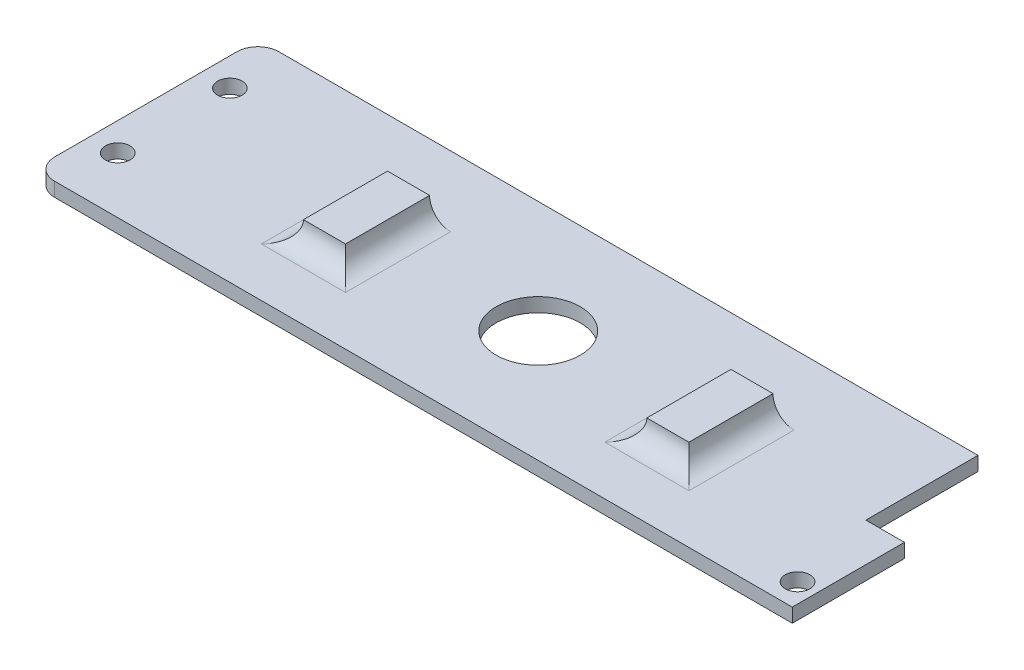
ISO-10303-21;
HEADER;
FILE_DESCRIPTION(('STEP AP214'),'2;1');
FILE_NAME('part.step','',(''),(''),'','','');
FILE_SCHEMA(('AUTOMOTIVE_DESIGN { 1 0 10303 214 1 1 1 1 }'));
ENDSEC;
DATA;
#1=APPLICATION_CONTEXT('core data for automotive mechanical design processes');
#2=APPLICATION_PROTOCOL_DEFINITION('international standard','automotive_design',2000,#1);
#3=PRODUCT_CONTEXT('',#1,'mechanical');
#4=PRODUCT('Part','Part','',(#3));
#5=PRODUCT_RELATED_PRODUCT_CATEGORY('part','',(#4));
#6=PRODUCT_DEFINITION_FORMATION('','',#4);
#7=PRODUCT_DEFINITION_CONTEXT('part definition',#1,'design');
#8=PRODUCT_DEFINITION('design','',#6,#7);
#9=PRODUCT_DEFINITION_SHAPE('','',#8);
#10=(LENGTH_UNIT() NAMED_UNIT(*) SI_UNIT(.MILLI.,.METRE.));
#11=(NAMED_UNIT(*) PLANE_ANGLE_UNIT() SI_UNIT($,.RADIAN.));
#12=(NAMED_UNIT(*) SI_UNIT($,.STERADIAN.) SOLID_ANGLE_UNIT());
#13=UNCERTAINTY_MEASURE_WITH_UNIT(LENGTH_MEASURE(1.E-05),#10,'distance_accuracy_value','');
#14=(GEOMETRIC_REPRESENTATION_CONTEXT(3) GLOBAL_UNCERTAINTY_ASSIGNED_CONTEXT((#13)) GLOBAL_UNIT_ASSIGNED_CONTEXT((#10,
#11,#12)) REPRESENTATION_CONTEXT('',''));
#15=CARTESIAN_POINT('',(0.,0.,0.));
#16=DIRECTION('',(0.,0.,1.));
#17=DIRECTION('',(1.,0.,0.));
#18=AXIS2_PLACEMENT_3D('',#15,#16,#17);
#19=CARTESIAN_POINT('',(-47.25,-2.01,-16.));
#20=DIRECTION('',(-1.,0.,0.));
#21=DIRECTION('',(0.,0.,1.));
#22=AXIS2_PLACEMENT_3D('',#19,#20,#21);
#23=PLANE('',#22);
#24=DIRECTION('',(0.,1.,0.));
#25=VECTOR('',#24,1.);
#26=CARTESIAN_POINT('',(-47.25,-2.01,0.));
#27=LINE('',#26,#25);
#28=CARTESIAN_POINT('',(-47.25,-2.,0.));
#29=VERTEX_POINT('',#28);
#30=CARTESIAN_POINT('',(-47.25,0.,0.));
#31=VERTEX_POINT('',#30);
#32=EDGE_CURVE('E11',#29,#31,#27,.T.);
#33=ORIENTED_EDGE('',*,*,#32,.F.);
#34=DIRECTION('',(0.,0.,-1.));
#35=VECTOR('',#34,1.);
#36=CARTESIAN_POINT('',(-47.25,-2.,0.));
#37=LINE('',#36,#35);
#38=CARTESIAN_POINT('',(-47.25,-2.,-16.));
#39=VERTEX_POINT('',#38);
#40=EDGE_CURVE('E398',#29,#39,#37,.T.);
#41=ORIENTED_EDGE('',*,*,#40,.T.);
#42=DIRECTION('',(0.,-1.,0.));
#43=VECTOR('',#42,1.);
#44=CARTESIAN_POINT('',(-47.25,-2.,-16.));
#45=LINE('',#44,#43);
#46=CARTESIAN_POINT('',(-47.25,0.,-16.));
#47=VERTEX_POINT('',#46);
#48=EDGE_CURVE('E62',#47,#39,#45,.T.);
#49=ORIENTED_EDGE('',*,*,#48,.F.);
#50=DIRECTION('',(0.,0.,-1.));
#51=VECTOR('',#50,1.);
#52=CARTESIAN_POINT('',(-47.25,0.,0.));
#53=LINE('',#52,#51);
#54=EDGE_CURVE('E407',#31,#47,#53,.T.);
#55=ORIENTED_EDGE('',*,*,#54,.F.);
#56=EDGE_LOOP('',(#33,#41,#49,#55));
#57=FACE_BOUND('',#56,.T.);
#58=ADVANCED_FACE('F37',(#57),#23,.F.);
#59=CARTESIAN_POINT('',(-47.25,-2.01,0.));
#60=DIRECTION('',(0.,0.,1.));
#61=DIRECTION('',(1.,0.,0.));
#62=AXIS2_PLACEMENT_3D('',#59,#60,#61);
#63=PLANE('',#62);
#64=DIRECTION('',(0.,1.,0.));
#65=VECTOR('',#64,1.);
#66=CARTESIAN_POINT('',(-41.75,-2.01,0.));
#67=LINE('',#66,#65);
#68=CARTESIAN_POINT('',(-41.75,-2.,0.));
#69=VERTEX_POINT('',#68);
#70=CARTESIAN_POINT('',(-41.75,0.,0.));
#71=VERTEX_POINT('',#70);
#72=EDGE_CURVE('E46',#69,#71,#67,.T.);
#73=ORIENTED_EDGE('',*,*,#72,.F.);
#74=DIRECTION('',(-1.,0.,0.));
#75=VECTOR('',#74,1.);
#76=CARTESIAN_POINT('',(0.,-2.,0.));
#77=LINE('',#76,#75);
#78=EDGE_CURVE('E400',#69,#29,#77,.T.);
#79=ORIENTED_EDGE('',*,*,#78,.T.);
#80=ORIENTED_EDGE('',*,*,#32,.T.);
#81=DIRECTION('',(-1.,0.,0.));
#82=VECTOR('',#81,1.);
#83=CARTESIAN_POINT('',(0.,0.,0.));
#84=LINE('',#83,#82);
#85=EDGE_CURVE('E411',#71,#31,#84,.T.);
#86=ORIENTED_EDGE('',*,*,#85,.F.);
#87=EDGE_LOOP('',(#73,#79,#80,#86));
#88=FACE_BOUND('',#87,.T.);
#89=ADVANCED_FACE('F420',(#88),#63,.F.);
#90=CARTESIAN_POINT('',(-41.75,-2.01,0.));
#91=DIRECTION('',(-1.,0.,0.));
#92=DIRECTION('',(0.,0.,1.));
#93=AXIS2_PLACEMENT_3D('',#90,#91,#92);
#94=PLANE('',#93);
#95=DIRECTION('',(0.,1.,0.));
#96=VECTOR('',#95,1.);
#97=CARTESIAN_POINT('',(-41.75,-2.,16.));
#98=LINE('',#97,#96);
#99=CARTESIAN_POINT('',(-41.75,-2.,16.));
#100=VERTEX_POINT('',#99);
#101=CARTESIAN_POINT('',(-41.75,0.,16.));
#102=VERTEX_POINT('',#101);
#103=EDGE_CURVE('E405',#100,#102,#98,.T.);
#104=ORIENTED_EDGE('',*,*,#103,.F.);
#105=DIRECTION('',(0.,0.,-1.));
#106=VECTOR('',#105,1.);
#107=CARTESIAN_POINT('',(-41.75,-2.,0.));
#108=LINE('',#107,#106);
#109=EDGE_CURVE('E54',#100,#69,#108,.T.);
#110=ORIENTED_EDGE('',*,*,#109,.T.);
#111=ORIENTED_EDGE('',*,*,#72,.T.);
#112=DIRECTION('',(0.,0.,-1.));
#113=VECTOR('',#112,1.);
#114=CARTESIAN_POINT('',(-41.75,0.,0.));
#115=LINE('',#114,#113);
#116=EDGE_CURVE('E41',#102,#71,#115,.T.);
#117=ORIENTED_EDGE('',*,*,#116,.F.);
#118=EDGE_LOOP('',(#104,#110,#111,#117));
#119=FACE_BOUND('',#118,.T.);
#120=ADVANCED_FACE('F39',(#119),#94,.F.);
#121=CARTESIAN_POINT('',(-115.5,3.,-5.99999999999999));
#122=DIRECTION('',(0.,0.,-1.));
#123=DIRECTION('',(-1.,0.,0.));
#124=AXIS2_PLACEMENT_3D('',#121,#122,#123);
#125=PLANE('',#124);
#126=DIRECTION('',(1.,0.,0.));
#127=VECTOR('',#126,1.);
#128=CARTESIAN_POINT('',(-115.5,0.,-5.99999999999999));
#129=LINE('',#128,#127);
#130=CARTESIAN_POINT('',(-124.5,0.,-5.99999999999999));
#131=VERTEX_POINT('',#130);
#132=CARTESIAN_POINT('',(-112.5,0.,-5.99999999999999));
#133=VERTEX_POINT('',#132);
#134=EDGE_CURVE('E289',#131,#133,#129,.T.);
#135=ORIENTED_EDGE('',*,*,#134,.F.);
#136=CARTESIAN_POINT('',(-124.5,3.,-5.99999999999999));
#137=DIRECTION('',(0.,0.,-1.));
#138=DIRECTION('',(-1.,0.,0.));
#139=AXIS2_PLACEMENT_3D('',#136,#137,#138);
#140=CIRCLE('',#139,3.);
#141=CARTESIAN_POINT('',(-121.5,3.,-5.99999999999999));
#142=VERTEX_POINT('',#141);
#143=EDGE_CURVE('E387',#131,#142,#140,.F.);
#144=ORIENTED_EDGE('',*,*,#143,.T.);
#145=DIRECTION('',(1.,0.,0.));
#146=VECTOR('',#145,1.);
#147=CARTESIAN_POINT('',(-115.5,3.,-5.99999999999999));
#148=LINE('',#147,#146);
#149=CARTESIAN_POINT('',(-115.5,3.,-5.99999999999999));
#150=VERTEX_POINT('',#149);
#151=EDGE_CURVE('E300',#142,#150,#148,.T.);
#152=ORIENTED_EDGE('',*,*,#151,.T.);
#153=CARTESIAN_POINT('',(-112.5,3.,-5.99999999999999));
#154=DIRECTION('',(0.,0.,-1.));
#155=DIRECTION('',(-1.,0.,0.));
#156=AXIS2_PLACEMENT_3D('',#153,#154,#155);
#157=CIRCLE('',#156,3.);
#158=EDGE_CURVE('E384',#150,#133,#157,.F.);
#159=ORIENTED_EDGE('',*,*,#158,.T.);
#160=EDGE_LOOP('',(#135,#144,#152,#159));
#161=FACE_BOUND('',#160,.T.);
#162=DIRECTION('',(-1.,0.,0.));
#163=VECTOR('',#162,1.);
#164=CARTESIAN_POINT('',(-116.25,2.25,-6.));
#165=LINE('',#164,#163);
#166=CARTESIAN_POINT('',(-116.25,2.25,-6.));
#167=VERTEX_POINT('',#166);
#168=CARTESIAN_POINT('',(-120.75,2.25,-5.99999999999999));
#169=VERTEX_POINT('',#168);
#170=EDGE_CURVE('E260',#167,#169,#165,.T.);
#171=ORIENTED_EDGE('',*,*,#170,.T.);
#172=DIRECTION('',(0.,-1.,0.));
#173=VECTOR('',#172,1.);
#174=CARTESIAN_POINT('',(-120.75,2.25,-6.));
#175=LINE('',#174,#173);
#176=CARTESIAN_POINT('',(-120.75,0.75,-6.));
#177=VERTEX_POINT('',#176);
#178=EDGE_CURVE('E257',#169,#177,#175,.T.);
#179=ORIENTED_EDGE('',*,*,#178,.T.);
#180=DIRECTION('',(1.,0.,0.));
#181=VECTOR('',#180,1.);
#182=CARTESIAN_POINT('',(-120.75,0.75,-6.));
#183=LINE('',#182,#181);
#184=CARTESIAN_POINT('',(-116.25,0.75,-6.));
#185=VERTEX_POINT('',#184);
#186=EDGE_CURVE('E250',#177,#185,#183,.T.);
#187=ORIENTED_EDGE('',*,*,#186,.T.);
#188=DIRECTION('',(0.,1.,0.));
#189=VECTOR('',#188,1.);
#190=CARTESIAN_POINT('',(-116.25,0.75,-6.));
#191=LINE('',#190,#189);
#192=EDGE_CURVE('E264',#185,#167,#191,.T.);
#193=ORIENTED_EDGE('',*,*,#192,.T.);
#194=EDGE_LOOP('',(#171,#179,#187,#193));
#195=FACE_BOUND('',#194,.T.);
#196=ADVANCED_FACE('F754',(#161,#195),#125,.T.);
#197=CARTESIAN_POINT('',(-66.5000000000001,3.,-6.));
#198=DIRECTION('',(0.,0.,-1.));
#199=DIRECTION('',(-1.,0.,0.));
#200=AXIS2_PLACEMENT_3D('',#197,#198,#199);
#201=PLANE('',#200);
#202=DIRECTION('',(1.,0.,0.));
#203=VECTOR('',#202,1.);
#204=CARTESIAN_POINT('',(-66.5000000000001,0.,-6.));
#205=LINE('',#204,#203);
#206=CARTESIAN_POINT('',(-75.5000000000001,0.,-6.));
#207=VERTEX_POINT('',#206);
#208=CARTESIAN_POINT('',(-63.5000000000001,0.,-6.));
#209=VERTEX_POINT('',#208);
#210=EDGE_CURVE('E242',#207,#209,#205,.T.);
#211=ORIENTED_EDGE('',*,*,#210,.F.);
#212=CARTESIAN_POINT('',(-75.5000000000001,3.,-6.));
#213=DIRECTION('',(0.,0.,-1.));
#214=DIRECTION('',(-1.,0.,0.));
#215=AXIS2_PLACEMENT_3D('',#212,#213,#214);
#216=CIRCLE('',#215,3.);
#217=CARTESIAN_POINT('',(-72.5000000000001,3.,-6.));
#218=VERTEX_POINT('',#217);
#219=EDGE_CURVE('E382',#207,#218,#216,.F.);
#220=ORIENTED_EDGE('',*,*,#219,.T.);
#221=DIRECTION('',(1.,0.,0.));
#222=VECTOR('',#221,1.);
#223=CARTESIAN_POINT('',(-66.5000000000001,3.,-6.));
#224=LINE('',#223,#222);
#225=CARTESIAN_POINT('',(-66.5000000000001,3.,-6.));
#226=VERTEX_POINT('',#225);
#227=EDGE_CURVE('E286',#218,#226,#224,.T.);
#228=ORIENTED_EDGE('',*,*,#227,.T.);
#229=CARTESIAN_POINT('',(-63.5000000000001,3.,-6.));
#230=DIRECTION('',(0.,0.,-1.));
#231=DIRECTION('',(-1.,0.,0.));
#232=AXIS2_PLACEMENT_3D('',#229,#230,#231);
#233=CIRCLE('',#232,3.);
#234=EDGE_CURVE('E379',#226,#209,#233,.F.);
#235=ORIENTED_EDGE('',*,*,#234,.T.);
#236=EDGE_LOOP('',(#211,#220,#228,#235));
#237=FACE_BOUND('',#236,.T.);
#238=DIRECTION('',(-1.,0.,0.));
#239=VECTOR('',#238,1.);
#240=CARTESIAN_POINT('',(-67.2500000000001,2.25,-6.));
#241=LINE('',#240,#239);
#242=CARTESIAN_POINT('',(-67.2500000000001,2.25,-6.));
#243=VERTEX_POINT('',#242);
#244=CARTESIAN_POINT('',(-71.7500000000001,2.25,-6.));
#245=VERTEX_POINT('',#244);
#246=EDGE_CURVE('E235',#243,#245,#241,.T.);
#247=ORIENTED_EDGE('',*,*,#246,.T.);
#248=DIRECTION('',(0.,-1.,0.));
#249=VECTOR('',#248,1.);
#250=CARTESIAN_POINT('',(-71.7500000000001,2.25,-6.));
#251=LINE('',#250,#249);
#252=CARTESIAN_POINT('',(-71.7500000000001,0.75,-6.));
#253=VERTEX_POINT('',#252);
#254=EDGE_CURVE('E222',#245,#253,#251,.T.);
#255=ORIENTED_EDGE('',*,*,#254,.T.);
#256=DIRECTION('',(1.,0.,0.));
#257=VECTOR('',#256,1.);
#258=CARTESIAN_POINT('',(-71.7500000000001,0.75,-6.));
#259=LINE('',#258,#257);
#260=CARTESIAN_POINT('',(-67.2500000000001,0.75,-6.));
#261=VERTEX_POINT('',#260);
#262=EDGE_CURVE('E226',#253,#261,#259,.T.);
#263=ORIENTED_EDGE('',*,*,#262,.T.);
#264=DIRECTION('',(0.,1.,0.));
#265=VECTOR('',#264,1.);
#266=CARTESIAN_POINT('',(-67.2500000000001,0.75,-6.));
#267=LINE('',#266,#265);
#268=EDGE_CURVE('E229',#261,#243,#267,.T.);
#269=ORIENTED_EDGE('',*,*,#268,.T.);
#270=EDGE_LOOP('',(#247,#255,#263,#269));
#271=FACE_BOUND('',#270,.T.);
#272=ADVANCED_FACE('F451',(#237,#271),#201,.T.);
#273=CARTESIAN_POINT('',(0.,0.,0.));
#274=DIRECTION('',(0.,-1.,0.));
#275=DIRECTION('',(0.,0.,-1.));
#276=AXIS2_PLACEMENT_3D('',#273,#274,#275);
#277=PLANE('',#276);
#278=ORIENTED_EDGE('',*,*,#210,.T.);
#279=DIRECTION('',(0.,0.,1.));
#280=VECTOR('',#279,1.);
#281=CARTESIAN_POINT('',(-63.5000000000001,0.,0.));
#282=LINE('',#281,#280);
#283=CARTESIAN_POINT('',(-63.5000000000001,0.,9.));
#284=VERTEX_POINT('',#283);
#285=EDGE_CURVE('E377',#209,#284,#282,.T.);
#286=ORIENTED_EDGE('',*,*,#285,.T.);
#287=DIRECTION('',(-1.,0.,0.));
#288=VECTOR('',#287,1.);
#289=CARTESIAN_POINT('',(0.,0.,9.));
#290=LINE('',#289,#288);
#291=CARTESIAN_POINT('',(-75.5000000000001,0.,9.));
#292=VERTEX_POINT('',#291);
#293=EDGE_CURVE('E374',#284,#292,#290,.T.);
#294=ORIENTED_EDGE('',*,*,#293,.T.);
#295=DIRECTION('',(0.,0.,-1.));
#296=VECTOR('',#295,1.);
#297=CARTESIAN_POINT('',(-75.5000000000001,0.,0.));
#298=LINE('',#297,#296);
#299=EDGE_CURVE('E371',#292,#207,#298,.T.);
#300=ORIENTED_EDGE('',*,*,#299,.T.);
#301=EDGE_LOOP('',(#278,#286,#294,#300));
#302=FACE_BOUND('',#301,.T.);
#303=ORIENTED_EDGE('',*,*,#134,.T.);
#304=DIRECTION('',(0.,0.,1.));
#305=VECTOR('',#304,1.);
#306=CARTESIAN_POINT('',(-112.5,0.,0.));
#307=LINE('',#306,#305);
#308=CARTESIAN_POINT('',(-112.5,0.,9.00000000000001));
#309=VERTEX_POINT('',#308);
#310=EDGE_CURVE('E369',#133,#309,#307,.T.);
#311=ORIENTED_EDGE('',*,*,#310,.T.);
#312=DIRECTION('',(-1.,0.,0.));
#313=VECTOR('',#312,1.);
#314=CARTESIAN_POINT('',(0.,0.,9.00000000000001));
#315=LINE('',#314,#313);
#316=CARTESIAN_POINT('',(-124.5,0.,9.00000000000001));
#317=VERTEX_POINT('',#316);
#318=EDGE_CURVE('E366',#309,#317,#315,.T.);
#319=ORIENTED_EDGE('',*,*,#318,.T.);
#320=DIRECTION('',(0.,0.,-1.));
#321=VECTOR('',#320,1.);
#322=CARTESIAN_POINT('',(-124.5,0.,0.));
#323=LINE('',#322,#321);
#324=EDGE_CURVE('E363',#317,#131,#323,.T.);
#325=ORIENTED_EDGE('',*,*,#324,.T.);
#326=EDGE_LOOP('',(#303,#311,#319,#325));
#327=FACE_BOUND('',#326,.T.);
#328=CARTESIAN_POINT('',(-146.,0.,8.));
#329=DIRECTION('',(0.,-1.,0.));
#330=DIRECTION('',(0.,0.,-1.));
#331=AXIS2_PLACEMENT_3D('',#328,#329,#330);
#332=CIRCLE('',#331,1.75000000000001);
#333=CARTESIAN_POINT('',(-146.,0.,6.24999999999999));
#334=VERTEX_POINT('',#333);
#335=EDGE_CURVE('E325',#334,#334,#332,.T.);
#336=ORIENTED_EDGE('',*,*,#335,.T.);
#337=EDGE_LOOP('',(#336));
#338=FACE_BOUND('',#337,.T.);
#339=CARTESIAN_POINT('',(-94.,0.,0.));
#340=DIRECTION('',(0.,-1.,0.));
#341=DIRECTION('',(0.,0.,-1.));
#342=AXIS2_PLACEMENT_3D('',#339,#340,#341);
#343=CIRCLE('',#342,6.);
#344=CARTESIAN_POINT('',(-94.,0.,-6.));
#345=VERTEX_POINT('',#344);
#346=EDGE_CURVE('E322',#345,#345,#343,.T.);
#347=ORIENTED_EDGE('',*,*,#346,.T.);
#348=EDGE_LOOP('',(#347));
#349=FACE_BOUND('',#348,.T.);
#350=CARTESIAN_POINT('',(-146.,0.,-8.));
#351=DIRECTION('',(0.,-1.,0.));
#352=DIRECTION('',(0.,0.,-1.));
#353=AXIS2_PLACEMENT_3D('',#350,#351,#352);
#354=CIRCLE('',#353,1.75000000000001);
#355=CARTESIAN_POINT('',(-146.,0.,-9.75000000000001));
#356=VERTEX_POINT('',#355);
#357=EDGE_CURVE('E319',#356,#356,#354,.T.);
#358=ORIENTED_EDGE('',*,*,#357,.T.);
#359=EDGE_LOOP('',(#358));
#360=FACE_BOUND('',#359,.T.);
#361=CARTESIAN_POINT('',(-44.5,0.,12.5));
#362=DIRECTION('',(0.,-1.,0.));
#363=DIRECTION('',(0.,0.,-1.));
#364=AXIS2_PLACEMENT_3D('',#361,#362,#363);
#365=CIRCLE('',#364,1.75);
#366=CARTESIAN_POINT('',(-44.5,0.,10.75));
#367=VERTEX_POINT('',#366);
#368=EDGE_CURVE('E314',#367,#367,#365,.T.);
#369=ORIENTED_EDGE('',*,*,#368,.T.);
#370=EDGE_LOOP('',(#369));
#371=FACE_BOUND('',#370,.T.);
#372=DIRECTION('',(-1.,0.,0.));
#373=VECTOR('',#372,1.);
#374=CARTESIAN_POINT('',(-150.,0.,16.));
#375=LINE('',#374,#373);
#376=CARTESIAN_POINT('',(-147.,0.,16.));
#377=VERTEX_POINT('',#376);
#378=EDGE_CURVE('E328',#102,#377,#375,.T.);
#379=ORIENTED_EDGE('',*,*,#378,.F.);
#380=ORIENTED_EDGE('',*,*,#116,.T.);
#381=ORIENTED_EDGE('',*,*,#85,.T.);
#382=ORIENTED_EDGE('',*,*,#54,.T.);
#383=DIRECTION('',(1.,0.,0.));
#384=VECTOR('',#383,1.);
#385=CARTESIAN_POINT('',(-150.,0.,-16.));
#386=LINE('',#385,#384);
#387=CARTESIAN_POINT('',(-147.,0.,-16.));
#388=VERTEX_POINT('',#387);
#389=EDGE_CURVE('E332',#388,#47,#386,.T.);
#390=ORIENTED_EDGE('',*,*,#389,.F.);
#391=CARTESIAN_POINT('',(-147.,0.,-13.));
#392=DIRECTION('',(0.,-1.,0.));
#393=DIRECTION('',(0.,0.,-1.));
#394=AXIS2_PLACEMENT_3D('',#391,#392,#393);
#395=CIRCLE('',#394,3.);
#396=CARTESIAN_POINT('',(-150.,0.,-13.));
#397=VERTEX_POINT('',#396);
#398=EDGE_CURVE('E348',#388,#397,#395,.F.);
#399=ORIENTED_EDGE('',*,*,#398,.T.);
#400=DIRECTION('',(0.,0.,-1.));
#401=VECTOR('',#400,1.);
#402=CARTESIAN_POINT('',(-150.,0.,16.));
#403=LINE('',#402,#401);
#404=CARTESIAN_POINT('',(-150.,0.,13.));
#405=VERTEX_POINT('',#404);
#406=EDGE_CURVE('E340',#405,#397,#403,.T.);
#407=ORIENTED_EDGE('',*,*,#406,.F.);
#408=CARTESIAN_POINT('',(-147.,0.,13.));
#409=DIRECTION('',(0.,-1.,0.));
#410=DIRECTION('',(0.,0.,-1.));
#411=AXIS2_PLACEMENT_3D('',#408,#409,#410);
#412=CIRCLE('',#411,3.);
#413=EDGE_CURVE('E350',#405,#377,#412,.F.);
#414=ORIENTED_EDGE('',*,*,#413,.T.);
#415=EDGE_LOOP('',(#379,#380,#381,#382,#390,#399,#407,#414));
#416=FACE_BOUND('',#415,.T.);
#417=ADVANCED_FACE('F416',(#302,#327,#338,#349,#360,#371,#416),#277,.F.);
#418=CARTESIAN_POINT('',(-150.,-2.,16.));
#419=DIRECTION('',(0.,0.,-1.));
#420=DIRECTION('',(-1.,0.,0.));
#421=AXIS2_PLACEMENT_3D('',#418,#419,#420);
#422=PLANE('',#421);
#423=DIRECTION('',(-1.,0.,0.));
#424=VECTOR('',#423,1.);
#425=CARTESIAN_POINT('',(-150.,-2.,16.));
#426=LINE('',#425,#424);
#427=CARTESIAN_POINT('',(-147.,-2.,16.));
#428=VERTEX_POINT('',#427);
#429=EDGE_CURVE('E329',#100,#428,#426,.T.);
#430=ORIENTED_EDGE('',*,*,#429,.F.);
#431=ORIENTED_EDGE('',*,*,#103,.T.);
#432=ORIENTED_EDGE('',*,*,#378,.T.);
#433=DIRECTION('',(0.,1.,0.));
#434=VECTOR('',#433,1.);
#435=CARTESIAN_POINT('',(-147.,-2.,16.));
#436=LINE('',#435,#434);
#437=EDGE_CURVE('E353',#377,#428,#436,.F.);
#438=ORIENTED_EDGE('',*,*,#437,.T.);
#439=EDGE_LOOP('',(#430,#431,#432,#438));
#440=FACE_BOUND('',#439,.T.);
#441=ADVANCED_FACE('F443',(#440),#422,.F.);
#442=CARTESIAN_POINT('',(-150.,-2.,16.));
#443=DIRECTION('',(1.,0.,0.));
#444=DIRECTION('',(0.,0.,-1.));
#445=AXIS2_PLACEMENT_3D('',#442,#443,#444);
#446=PLANE('',#445);
#447=DIRECTION('',(0.,0.,-1.));
#448=VECTOR('',#447,1.);
#449=CARTESIAN_POINT('',(-150.,-2.,16.));
#450=LINE('',#449,#448);
#451=CARTESIAN_POINT('',(-150.,-2.,13.));
#452=VERTEX_POINT('',#451);
#453=CARTESIAN_POINT('',(-150.,-2.,-13.));
#454=VERTEX_POINT('',#453);
#455=EDGE_CURVE('E331',#452,#454,#450,.T.);
#456=ORIENTED_EDGE('',*,*,#455,.F.);
#457=DIRECTION('',(0.,1.,0.));
#458=VECTOR('',#457,1.);
#459=CARTESIAN_POINT('',(-150.,-2.,13.));
#460=LINE('',#459,#458);
#461=EDGE_CURVE('E345',#452,#405,#460,.T.);
#462=ORIENTED_EDGE('',*,*,#461,.T.);
#463=ORIENTED_EDGE('',*,*,#406,.T.);
#464=DIRECTION('',(0.,1.,0.));
#465=VECTOR('',#464,1.);
#466=CARTESIAN_POINT('',(-150.,-2.,-13.));
#467=LINE('',#466,#465);
#468=EDGE_CURVE('E338',#397,#454,#467,.F.);
#469=ORIENTED_EDGE('',*,*,#468,.T.);
#470=EDGE_LOOP('',(#456,#462,#463,#469));
#471=FACE_BOUND('',#470,.T.);
#472=ADVANCED_FACE('F433',(#471),#446,.F.);
#473=CARTESIAN_POINT('',(-150.,-2.,-16.));
#474=DIRECTION('',(0.,0.,1.));
#475=DIRECTION('',(1.,0.,0.));
#476=AXIS2_PLACEMENT_3D('',#473,#474,#475);
#477=PLANE('',#476);
#478=ORIENTED_EDGE('',*,*,#389,.T.);
#479=ORIENTED_EDGE('',*,*,#48,.T.);
#480=DIRECTION('',(1.,0.,0.));
#481=VECTOR('',#480,1.);
#482=CARTESIAN_POINT('',(-150.,-2.,-16.));
#483=LINE('',#482,#481);
#484=CARTESIAN_POINT('',(-147.,-2.,-16.));
#485=VERTEX_POINT('',#484);
#486=EDGE_CURVE('E335',#485,#39,#483,.T.);
#487=ORIENTED_EDGE('',*,*,#486,.F.);
#488=DIRECTION('',(0.,1.,0.));
#489=VECTOR('',#488,1.);
#490=CARTESIAN_POINT('',(-147.,-2.,-16.));
#491=LINE('',#490,#489);
#492=EDGE_CURVE('E360',#485,#388,#491,.T.);
#493=ORIENTED_EDGE('',*,*,#492,.T.);
#494=EDGE_LOOP('',(#478,#479,#487,#493));
#495=FACE_BOUND('',#494,.T.);
#496=ADVANCED_FACE('F425',(#495),#477,.F.);
#497=CARTESIAN_POINT('',(0.,-2.,0.));
#498=DIRECTION('',(0.,-1.,0.));
#499=DIRECTION('',(0.,0.,-1.));
#500=AXIS2_PLACEMENT_3D('',#497,#498,#499);
#501=PLANE('',#500);
#502=ORIENTED_EDGE('',*,*,#109,.F.);
#503=ORIENTED_EDGE('',*,*,#429,.T.);
#504=CARTESIAN_POINT('',(-147.,-2.,13.));
#505=DIRECTION('',(0.,-1.,0.));
#506=DIRECTION('',(0.,0.,-1.));
#507=AXIS2_PLACEMENT_3D('',#504,#505,#506);
#508=CIRCLE('',#507,3.);
#509=EDGE_CURVE('E358',#428,#452,#508,.T.);
#510=ORIENTED_EDGE('',*,*,#509,.T.);
#511=ORIENTED_EDGE('',*,*,#455,.T.);
#512=CARTESIAN_POINT('',(-147.,-2.,-13.));
#513=DIRECTION('',(0.,-1.,0.));
#514=DIRECTION('',(0.,0.,-1.));
#515=AXIS2_PLACEMENT_3D('',#512,#513,#514);
#516=CIRCLE('',#515,3.);
#517=EDGE_CURVE('E356',#454,#485,#516,.T.);
#518=ORIENTED_EDGE('',*,*,#517,.T.);
#519=ORIENTED_EDGE('',*,*,#486,.T.);
#520=ORIENTED_EDGE('',*,*,#40,.F.);
#521=ORIENTED_EDGE('',*,*,#78,.F.);
#522=EDGE_LOOP('',(#502,#503,#510,#511,#518,#519,#520,#521));
#523=FACE_BOUND('',#522,.T.);
#524=CARTESIAN_POINT('',(-146.,-2.,8.));
#525=DIRECTION('',(0.,1.,0.));
#526=DIRECTION('',(0.,0.,1.));
#527=AXIS2_PLACEMENT_3D('',#524,#525,#526);
#528=CIRCLE('',#527,1.75000000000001);
#529=CARTESIAN_POINT('',(-146.,-2.,9.75000000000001));
#530=VERTEX_POINT('',#529);
#531=EDGE_CURVE('E311',#530,#530,#528,.T.);
#532=ORIENTED_EDGE('',*,*,#531,.T.);
#533=EDGE_LOOP('',(#532));
#534=FACE_BOUND('',#533,.T.);
#535=CARTESIAN_POINT('',(-94.,-2.,0.));
#536=DIRECTION('',(0.,1.,0.));
#537=DIRECTION('',(0.,0.,1.));
#538=AXIS2_PLACEMENT_3D('',#535,#536,#537);
#539=CIRCLE('',#538,6.);
#540=CARTESIAN_POINT('',(-94.,-2.,6.));
#541=VERTEX_POINT('',#540);
#542=EDGE_CURVE('E310',#541,#541,#539,.T.);
#543=ORIENTED_EDGE('',*,*,#542,.T.);
#544=EDGE_LOOP('',(#543));
#545=FACE_BOUND('',#544,.T.);
#546=CARTESIAN_POINT('',(-146.,-2.,-8.));
#547=DIRECTION('',(0.,1.,0.));
#548=DIRECTION('',(0.,0.,1.));
#549=AXIS2_PLACEMENT_3D('',#546,#547,#548);
#550=CIRCLE('',#549,1.75000000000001);
#551=CARTESIAN_POINT('',(-146.,-2.,-6.24999999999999));
#552=VERTEX_POINT('',#551);
#553=EDGE_CURVE('E303',#552,#552,#550,.T.);
#554=ORIENTED_EDGE('',*,*,#553,.T.);
#555=EDGE_LOOP('',(#554));
#556=FACE_BOUND('',#555,.T.);
#557=CARTESIAN_POINT('',(-44.5,-2.,12.5));
#558=DIRECTION('',(0.,1.,0.));
#559=DIRECTION('',(0.,0.,-1.));
#560=AXIS2_PLACEMENT_3D('',#557,#558,#559);
#561=CIRCLE('',#560,1.75);
#562=CARTESIAN_POINT('',(-44.5,-2.,10.75));
#563=VERTEX_POINT('',#562);
#564=EDGE_CURVE('E307',#563,#563,#561,.T.);
#565=ORIENTED_EDGE('',*,*,#564,.T.);
#566=EDGE_LOOP('',(#565));
#567=FACE_BOUND('',#566,.T.);
#568=ADVANCED_FACE('F435',(#523,#534,#545,#556,#567),#501,.T.);
#569=CARTESIAN_POINT('',(-44.5,-2.,12.5));
#570=DIRECTION('',(0.,1.,0.));
#571=DIRECTION('',(0.,0.,1.));
#572=AXIS2_PLACEMENT_3D('',#569,#570,#571);
#573=CYLINDRICAL_SURFACE('',#572,1.75);
#574=ORIENTED_EDGE('',*,*,#564,.F.);
#575=EDGE_LOOP('',(#574));
#576=FACE_BOUND('',#575,.T.);
#577=ORIENTED_EDGE('',*,*,#368,.F.);
#578=EDGE_LOOP('',(#577));
#579=FACE_BOUND('',#578,.T.);
#580=ADVANCED_FACE('F505',(#576,#579),#573,.F.);
#581=CARTESIAN_POINT('',(-146.,-2.,-8.));
#582=DIRECTION('',(0.,1.,0.));
#583=DIRECTION('',(0.,0.,1.));
#584=AXIS2_PLACEMENT_3D('',#581,#582,#583);
#585=CYLINDRICAL_SURFACE('',#584,1.75000000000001);
#586=ORIENTED_EDGE('',*,*,#553,.F.);
#587=EDGE_LOOP('',(#586));
#588=FACE_BOUND('',#587,.T.);
#589=ORIENTED_EDGE('',*,*,#357,.F.);
#590=EDGE_LOOP('',(#589));
#591=FACE_BOUND('',#590,.T.);
#592=ADVANCED_FACE('F499',(#588,#591),#585,.F.);
#593=CARTESIAN_POINT('',(-94.,-2.,0.));
#594=DIRECTION('',(0.,1.,0.));
#595=DIRECTION('',(0.,0.,1.));
#596=AXIS2_PLACEMENT_3D('',#593,#594,#595);
#597=CYLINDRICAL_SURFACE('',#596,6.);
#598=ORIENTED_EDGE('',*,*,#542,.F.);
#599=EDGE_LOOP('',(#598));
#600=FACE_BOUND('',#599,.T.);
#601=ORIENTED_EDGE('',*,*,#346,.F.);
#602=EDGE_LOOP('',(#601));
#603=FACE_BOUND('',#602,.T.);
#604=ADVANCED_FACE('F493',(#600,#603),#597,.F.);
#605=CARTESIAN_POINT('',(-146.,-2.,8.));
#606=DIRECTION('',(0.,1.,0.));
#607=DIRECTION('',(0.,0.,1.));
#608=AXIS2_PLACEMENT_3D('',#605,#606,#607);
#609=CYLINDRICAL_SURFACE('',#608,1.75000000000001);
#610=ORIENTED_EDGE('',*,*,#531,.F.);
#611=EDGE_LOOP('',(#610));
#612=FACE_BOUND('',#611,.T.);
#613=ORIENTED_EDGE('',*,*,#335,.F.);
#614=EDGE_LOOP('',(#613));
#615=FACE_BOUND('',#614,.T.);
#616=ADVANCED_FACE('F489',(#612,#615),#609,.F.);
#617=CARTESIAN_POINT('',(-147.,-2.,13.));
#618=DIRECTION('',(0.,1.,0.));
#619=DIRECTION('',(0.,0.,1.));
#620=AXIS2_PLACEMENT_3D('',#617,#618,#619);
#621=CYLINDRICAL_SURFACE('',#620,3.);
#622=ORIENTED_EDGE('',*,*,#509,.F.);
#623=ORIENTED_EDGE('',*,*,#437,.F.);
#624=ORIENTED_EDGE('',*,*,#413,.F.);
#625=ORIENTED_EDGE('',*,*,#461,.F.);
#626=EDGE_LOOP('',(#622,#623,#624,#625));
#627=FACE_BOUND('',#626,.T.);
#628=ADVANCED_FACE('F441',(#627),#621,.T.);
#629=CARTESIAN_POINT('',(-147.,-2.,-13.));
#630=DIRECTION('',(0.,1.,0.));
#631=DIRECTION('',(0.,0.,1.));
#632=AXIS2_PLACEMENT_3D('',#629,#630,#631);
#633=CYLINDRICAL_SURFACE('',#632,3.);
#634=ORIENTED_EDGE('',*,*,#517,.F.);
#635=ORIENTED_EDGE('',*,*,#468,.F.);
#636=ORIENTED_EDGE('',*,*,#398,.F.);
#637=ORIENTED_EDGE('',*,*,#492,.F.);
#638=EDGE_LOOP('',(#634,#635,#636,#637));
#639=FACE_BOUND('',#638,.T.);
#640=ADVANCED_FACE('F429',(#639),#633,.T.);
#641=CARTESIAN_POINT('',(-94.0000000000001,3.,0.));
#642=DIRECTION('',(0.,1.,0.));
#643=DIRECTION('',(0.,0.,1.));
#644=AXIS2_PLACEMENT_3D('',#641,#642,#643);
#645=PLANE('',#644);
#646=DIRECTION('',(0.,0.,-1.));
#647=VECTOR('',#646,1.);
#648=CARTESIAN_POINT('',(-121.5,3.,-5.99999999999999));
#649=LINE('',#648,#647);
#650=CARTESIAN_POINT('',(-121.5,3.,6.00000000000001));
#651=VERTEX_POINT('',#650);
#652=EDGE_CURVE('E291',#651,#142,#649,.T.);
#653=ORIENTED_EDGE('',*,*,#652,.F.);
#654=DIRECTION('',(-1.,0.,0.));
#655=VECTOR('',#654,1.);
#656=CARTESIAN_POINT('',(-115.5,3.,6.00000000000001));
#657=LINE('',#656,#655);
#658=CARTESIAN_POINT('',(-115.5,3.,6.00000000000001));
#659=VERTEX_POINT('',#658);
#660=EDGE_CURVE('E294',#659,#651,#657,.T.);
#661=ORIENTED_EDGE('',*,*,#660,.F.);
#662=DIRECTION('',(0.,0.,1.));
#663=VECTOR('',#662,1.);
#664=CARTESIAN_POINT('',(-115.5,3.,-5.99999999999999));
#665=LINE('',#664,#663);
#666=EDGE_CURVE('E297',#150,#659,#665,.T.);
#667=ORIENTED_EDGE('',*,*,#666,.F.);
#668=ORIENTED_EDGE('',*,*,#151,.F.);
#669=EDGE_LOOP('',(#653,#661,#667,#668));
#670=FACE_BOUND('',#669,.T.);
#671=ADVANCED_FACE('F487',(#670),#645,.T.);
#672=CARTESIAN_POINT('',(-94.0000000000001,3.,0.));
#673=DIRECTION('',(0.,1.,0.));
#674=DIRECTION('',(0.,0.,1.));
#675=AXIS2_PLACEMENT_3D('',#672,#673,#674);
#676=PLANE('',#675);
#677=DIRECTION('',(0.,0.,-1.));
#678=VECTOR('',#677,1.);
#679=CARTESIAN_POINT('',(-72.5000000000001,3.,-6.));
#680=LINE('',#679,#678);
#681=CARTESIAN_POINT('',(-72.5000000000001,3.,6.));
#682=VERTEX_POINT('',#681);
#683=EDGE_CURVE('E277',#682,#218,#680,.T.);
#684=ORIENTED_EDGE('',*,*,#683,.F.);
#685=DIRECTION('',(-1.,0.,0.));
#686=VECTOR('',#685,1.);
#687=CARTESIAN_POINT('',(-66.5000000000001,3.,6.));
#688=LINE('',#687,#686);
#689=CARTESIAN_POINT('',(-66.5000000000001,3.,6.));
#690=VERTEX_POINT('',#689);
#691=EDGE_CURVE('E280',#690,#682,#688,.T.);
#692=ORIENTED_EDGE('',*,*,#691,.F.);
#693=DIRECTION('',(0.,0.,1.));
#694=VECTOR('',#693,1.);
#695=CARTESIAN_POINT('',(-66.5000000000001,3.,-6.));
#696=LINE('',#695,#694);
#697=EDGE_CURVE('E283',#226,#690,#696,.T.);
#698=ORIENTED_EDGE('',*,*,#697,.F.);
#699=ORIENTED_EDGE('',*,*,#227,.F.);
#700=EDGE_LOOP('',(#684,#692,#698,#699));
#701=FACE_BOUND('',#700,.T.);
#702=ADVANCED_FACE('F567',(#701),#676,.T.);
#703=CARTESIAN_POINT('',(-71.7500000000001,2.25,4.));
#704=DIRECTION('',(1.,0.,0.));
#705=DIRECTION('',(0.,0.,-1.));
#706=AXIS2_PLACEMENT_3D('',#703,#704,#705);
#707=PLANE('',#706);
#708=ORIENTED_EDGE('',*,*,#254,.F.);
#709=DIRECTION('',(0.,0.,-1.));
#710=VECTOR('',#709,1.);
#711=CARTESIAN_POINT('',(-71.7500000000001,2.25,4.));
#712=LINE('',#711,#710);
#713=CARTESIAN_POINT('',(-71.7500000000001,2.25,4.));
#714=VERTEX_POINT('',#713);
#715=EDGE_CURVE('E207',#714,#245,#712,.T.);
#716=ORIENTED_EDGE('',*,*,#715,.F.);
#717=DIRECTION('',(0.,-1.,0.));
#718=VECTOR('',#717,1.);
#719=CARTESIAN_POINT('',(-71.7500000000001,2.25,4.));
#720=LINE('',#719,#718);
#721=CARTESIAN_POINT('',(-71.7500000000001,0.75,4.));
#722=VERTEX_POINT('',#721);
#723=EDGE_CURVE('E214',#714,#722,#720,.T.);
#724=ORIENTED_EDGE('',*,*,#723,.T.);
#725=DIRECTION('',(0.,0.,-1.));
#726=VECTOR('',#725,1.);
#727=CARTESIAN_POINT('',(-71.7500000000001,0.75,4.));
#728=LINE('',#727,#726);
#729=EDGE_CURVE('E240',#722,#253,#728,.T.);
#730=ORIENTED_EDGE('',*,*,#729,.T.);
#731=EDGE_LOOP('',(#708,#716,#724,#730));
#732=FACE_BOUND('',#731,.T.);
#733=ADVANCED_FACE('F218',(#732),#707,.T.);
#734=CARTESIAN_POINT('',(-71.7500000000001,0.75,4.));
#735=DIRECTION('',(0.,1.,0.));
#736=DIRECTION('',(0.,0.,1.));
#737=AXIS2_PLACEMENT_3D('',#734,#735,#736);
#738=PLANE('',#737);
#739=ORIENTED_EDGE('',*,*,#262,.F.);
#740=ORIENTED_EDGE('',*,*,#729,.F.);
#741=DIRECTION('',(1.,0.,0.));
#742=VECTOR('',#741,1.);
#743=CARTESIAN_POINT('',(-71.7500000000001,0.75,4.));
#744=LINE('',#743,#742);
#745=CARTESIAN_POINT('',(-67.2500000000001,0.75,4.));
#746=VERTEX_POINT('',#745);
#747=EDGE_CURVE('E223',#722,#746,#744,.T.);
#748=ORIENTED_EDGE('',*,*,#747,.T.);
#749=DIRECTION('',(0.,0.,-1.));
#750=VECTOR('',#749,1.);
#751=CARTESIAN_POINT('',(-67.2500000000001,0.75,4.));
#752=LINE('',#751,#750);
#753=EDGE_CURVE('E243',#746,#261,#752,.T.);
#754=ORIENTED_EDGE('',*,*,#753,.T.);
#755=EDGE_LOOP('',(#739,#740,#748,#754));
#756=FACE_BOUND('',#755,.T.);
#757=ADVANCED_FACE('F589',(#756),#738,.T.);
#758=CARTESIAN_POINT('',(-67.2500000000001,0.75,4.));
#759=DIRECTION('',(-1.,0.,0.));
#760=DIRECTION('',(0.,0.,1.));
#761=AXIS2_PLACEMENT_3D('',#758,#759,#760);
#762=PLANE('',#761);
#763=ORIENTED_EDGE('',*,*,#268,.F.);
#764=ORIENTED_EDGE('',*,*,#753,.F.);
#765=DIRECTION('',(0.,1.,0.));
#766=VECTOR('',#765,1.);
#767=CARTESIAN_POINT('',(-67.2500000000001,0.75,4.));
#768=LINE('',#767,#766);
#769=CARTESIAN_POINT('',(-67.2500000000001,2.25,4.));
#770=VERTEX_POINT('',#769);
#771=EDGE_CURVE('E213',#746,#770,#768,.T.);
#772=ORIENTED_EDGE('',*,*,#771,.T.);
#773=DIRECTION('',(0.,0.,-1.));
#774=VECTOR('',#773,1.);
#775=CARTESIAN_POINT('',(-67.2500000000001,2.25,4.));
#776=LINE('',#775,#774);
#777=EDGE_CURVE('E209',#770,#243,#776,.T.);
#778=ORIENTED_EDGE('',*,*,#777,.T.);
#779=EDGE_LOOP('',(#763,#764,#772,#778));
#780=FACE_BOUND('',#779,.T.);
#781=ADVANCED_FACE('F599',(#780),#762,.T.);
#782=CARTESIAN_POINT('',(-67.2500000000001,2.25,4.));
#783=DIRECTION('',(0.,-1.,0.));
#784=DIRECTION('',(0.,0.,-1.));
#785=AXIS2_PLACEMENT_3D('',#782,#783,#784);
#786=PLANE('',#785);
#787=ORIENTED_EDGE('',*,*,#246,.F.);
#788=ORIENTED_EDGE('',*,*,#777,.F.);
#789=DIRECTION('',(-1.,0.,0.));
#790=VECTOR('',#789,1.);
#791=CARTESIAN_POINT('',(-67.2500000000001,2.25,4.));
#792=LINE('',#791,#790);
#793=EDGE_CURVE('E203',#770,#714,#792,.T.);
#794=ORIENTED_EDGE('',*,*,#793,.T.);
#795=ORIENTED_EDGE('',*,*,#715,.T.);
#796=EDGE_LOOP('',(#787,#788,#794,#795));
#797=FACE_BOUND('',#796,.T.);
#798=ADVANCED_FACE('F206',(#797),#786,.T.);
#799=CARTESIAN_POINT('',(-94.0000000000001,0.,4.));
#800=DIRECTION('',(0.,0.,-1.));
#801=DIRECTION('',(1.,0.,0.));
#802=AXIS2_PLACEMENT_3D('',#799,#800,#801);
#803=PLANE('',#802);
#804=ORIENTED_EDGE('',*,*,#723,.F.);
#805=ORIENTED_EDGE('',*,*,#793,.F.);
#806=ORIENTED_EDGE('',*,*,#771,.F.);
#807=ORIENTED_EDGE('',*,*,#747,.F.);
#808=EDGE_LOOP('',(#804,#805,#806,#807));
#809=FACE_BOUND('',#808,.T.);
#810=ADVANCED_FACE('F225',(#809),#803,.T.);
#811=CARTESIAN_POINT('',(-120.75,2.25,4.));
#812=DIRECTION('',(1.,0.,0.));
#813=DIRECTION('',(0.,0.,-1.));
#814=AXIS2_PLACEMENT_3D('',#811,#812,#813);
#815=PLANE('',#814);
#816=ORIENTED_EDGE('',*,*,#178,.F.);
#817=DIRECTION('',(0.,0.,-1.));
#818=VECTOR('',#817,1.);
#819=CARTESIAN_POINT('',(-120.75,2.25,4.));
#820=LINE('',#819,#818);
#821=CARTESIAN_POINT('',(-120.75,2.25,4.));
#822=VERTEX_POINT('',#821);
#823=EDGE_CURVE('E256',#822,#169,#820,.T.);
#824=ORIENTED_EDGE('',*,*,#823,.F.);
#825=DIRECTION('',(0.,-1.,0.));
#826=VECTOR('',#825,1.);
#827=CARTESIAN_POINT('',(-120.75,2.25,4.));
#828=LINE('',#827,#826);
#829=CARTESIAN_POINT('',(-120.75,0.75,4.));
#830=VERTEX_POINT('',#829);
#831=EDGE_CURVE('E246',#822,#830,#828,.T.);
#832=ORIENTED_EDGE('',*,*,#831,.T.);
#833=DIRECTION('',(0.,0.,-1.));
#834=VECTOR('',#833,1.);
#835=CARTESIAN_POINT('',(-120.75,0.75,4.));
#836=LINE('',#835,#834);
#837=EDGE_CURVE('E236',#830,#177,#836,.T.);
#838=ORIENTED_EDGE('',*,*,#837,.T.);
#839=EDGE_LOOP('',(#816,#824,#832,#838));
#840=FACE_BOUND('',#839,.T.);
#841=ADVANCED_FACE('F629',(#840),#815,.T.);
#842=CARTESIAN_POINT('',(-120.75,0.75,4.));
#843=DIRECTION('',(0.,1.,0.));
#844=DIRECTION('',(0.,0.,1.));
#845=AXIS2_PLACEMENT_3D('',#842,#843,#844);
#846=PLANE('',#845);
#847=ORIENTED_EDGE('',*,*,#186,.F.);
#848=ORIENTED_EDGE('',*,*,#837,.F.);
#849=DIRECTION('',(1.,0.,0.));
#850=VECTOR('',#849,1.);
#851=CARTESIAN_POINT('',(-120.75,0.75,4.));
#852=LINE('',#851,#850);
#853=CARTESIAN_POINT('',(-116.25,0.75,4.));
#854=VERTEX_POINT('',#853);
#855=EDGE_CURVE('E254',#830,#854,#852,.T.);
#856=ORIENTED_EDGE('',*,*,#855,.T.);
#857=DIRECTION('',(0.,0.,-1.));
#858=VECTOR('',#857,1.);
#859=CARTESIAN_POINT('',(-116.25,0.75,4.));
#860=LINE('',#859,#858);
#861=EDGE_CURVE('E271',#854,#185,#860,.T.);
#862=ORIENTED_EDGE('',*,*,#861,.T.);
#863=EDGE_LOOP('',(#847,#848,#856,#862));
#864=FACE_BOUND('',#863,.T.);
#865=ADVANCED_FACE('F639',(#864),#846,.T.);
#866=CARTESIAN_POINT('',(-116.25,0.75,4.));
#867=DIRECTION('',(-1.,0.,0.));
#868=DIRECTION('',(0.,0.,1.));
#869=AXIS2_PLACEMENT_3D('',#866,#867,#868);
#870=PLANE('',#869);
#871=ORIENTED_EDGE('',*,*,#192,.F.);
#872=ORIENTED_EDGE('',*,*,#861,.F.);
#873=DIRECTION('',(0.,1.,0.));
#874=VECTOR('',#873,1.);
#875=CARTESIAN_POINT('',(-116.25,0.75,4.));
#876=LINE('',#875,#874);
#877=CARTESIAN_POINT('',(-116.25,2.25,4.));
#878=VERTEX_POINT('',#877);
#879=EDGE_CURVE('E252',#854,#878,#876,.T.);
#880=ORIENTED_EDGE('',*,*,#879,.T.);
#881=DIRECTION('',(0.,0.,-1.));
#882=VECTOR('',#881,1.);
#883=CARTESIAN_POINT('',(-116.25,2.25,4.));
#884=LINE('',#883,#882);
#885=EDGE_CURVE('E273',#878,#167,#884,.T.);
#886=ORIENTED_EDGE('',*,*,#885,.T.);
#887=EDGE_LOOP('',(#871,#872,#880,#886));
#888=FACE_BOUND('',#887,.T.);
#889=ADVANCED_FACE('F650',(#888),#870,.T.);
#890=CARTESIAN_POINT('',(-116.25,2.25,4.));
#891=DIRECTION('',(0.,-1.,0.));
#892=DIRECTION('',(0.,0.,-1.));
#893=AXIS2_PLACEMENT_3D('',#890,#891,#892);
#894=PLANE('',#893);
#895=ORIENTED_EDGE('',*,*,#170,.F.);
#896=ORIENTED_EDGE('',*,*,#885,.F.);
#897=DIRECTION('',(-1.,0.,0.));
#898=VECTOR('',#897,1.);
#899=CARTESIAN_POINT('',(-116.25,2.25,4.));
#900=LINE('',#899,#898);
#901=EDGE_CURVE('E249',#878,#822,#900,.T.);
#902=ORIENTED_EDGE('',*,*,#901,.T.);
#903=ORIENTED_EDGE('',*,*,#823,.T.);
#904=EDGE_LOOP('',(#895,#896,#902,#903));
#905=FACE_BOUND('',#904,.T.);
#906=ADVANCED_FACE('F661',(#905),#894,.T.);
#907=CARTESIAN_POINT('',(-94.0000000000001,0.,4.));
#908=DIRECTION('',(0.,0.,-1.));
#909=DIRECTION('',(1.,0.,0.));
#910=AXIS2_PLACEMENT_3D('',#907,#908,#909);
#911=PLANE('',#910);
#912=ORIENTED_EDGE('',*,*,#831,.F.);
#913=ORIENTED_EDGE('',*,*,#901,.F.);
#914=ORIENTED_EDGE('',*,*,#879,.F.);
#915=ORIENTED_EDGE('',*,*,#855,.F.);
#916=EDGE_LOOP('',(#912,#913,#914,#915));
#917=FACE_BOUND('',#916,.T.);
#918=ADVANCED_FACE('F478',(#917),#911,.T.);
#919=CARTESIAN_POINT('',(-112.5,3.,0.));
#920=DIRECTION('',(0.,0.,1.));
#921=DIRECTION('',(1.,0.,0.));
#922=AXIS2_PLACEMENT_3D('',#919,#920,#921);
#923=CYLINDRICAL_SURFACE('',#922,3.);
#924=ORIENTED_EDGE('',*,*,#158,.F.);
#925=ORIENTED_EDGE('',*,*,#666,.T.);
#926=CARTESIAN_POINT('',(-112.5,3.,9.00000000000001));
#927=DIRECTION('',(-0.707106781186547,0.,0.707106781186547));
#928=DIRECTION('',(0.707106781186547,0.,0.707106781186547));
#929=AXIS2_PLACEMENT_3D('',#926,#927,#928);
#930=ELLIPSE('',#929,4.24264068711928,3.);
#931=EDGE_CURVE('E261',#309,#659,#930,.F.);
#932=ORIENTED_EDGE('',*,*,#931,.F.);
#933=ORIENTED_EDGE('',*,*,#310,.F.);
#934=EDGE_LOOP('',(#924,#925,#932,#933));
#935=FACE_BOUND('',#934,.T.);
#936=ADVANCED_FACE('F474',(#935),#923,.F.);
#937=CARTESIAN_POINT('',(-124.5,3.,0.));
#938=DIRECTION('',(0.,0.,-1.));
#939=DIRECTION('',(-1.,0.,0.));
#940=AXIS2_PLACEMENT_3D('',#937,#938,#939);
#941=CYLINDRICAL_SURFACE('',#940,3.);
#942=ORIENTED_EDGE('',*,*,#143,.F.);
#943=ORIENTED_EDGE('',*,*,#324,.F.);
#944=CARTESIAN_POINT('',(-124.5,3.,9.00000000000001));
#945=DIRECTION('',(-0.707106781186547,0.,-0.707106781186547));
#946=DIRECTION('',(0.707106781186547,0.,-0.707106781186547));
#947=AXIS2_PLACEMENT_3D('',#944,#945,#946);
#948=ELLIPSE('',#947,4.24264068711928,3.);
#949=EDGE_CURVE('E389',#651,#317,#948,.T.);
#950=ORIENTED_EDGE('',*,*,#949,.F.);
#951=ORIENTED_EDGE('',*,*,#652,.T.);
#952=EDGE_LOOP('',(#942,#943,#950,#951));
#953=FACE_BOUND('',#952,.T.);
#954=ADVANCED_FACE('F477',(#953),#941,.F.);
#955=CARTESIAN_POINT('',(0.,3.,9.00000000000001));
#956=DIRECTION('',(-1.,0.,0.));
#957=DIRECTION('',(0.,0.,1.));
#958=AXIS2_PLACEMENT_3D('',#955,#956,#957);
#959=CYLINDRICAL_SURFACE('',#958,3.);
#960=ORIENTED_EDGE('',*,*,#931,.T.);
#961=ORIENTED_EDGE('',*,*,#660,.T.);
#962=ORIENTED_EDGE('',*,*,#949,.T.);
#963=ORIENTED_EDGE('',*,*,#318,.F.);
#964=EDGE_LOOP('',(#960,#961,#962,#963));
#965=FACE_BOUND('',#964,.T.);
#966=ADVANCED_FACE('F465',(#965),#959,.F.);
#967=CARTESIAN_POINT('',(-63.5000000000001,3.,0.));
#968=DIRECTION('',(0.,0.,1.));
#969=DIRECTION('',(1.,0.,0.));
#970=AXIS2_PLACEMENT_3D('',#967,#968,#969);
#971=CYLINDRICAL_SURFACE('',#970,3.);
#972=ORIENTED_EDGE('',*,*,#234,.F.);
#973=ORIENTED_EDGE('',*,*,#697,.T.);
#974=CARTESIAN_POINT('',(-63.5000000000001,3.,9.));
#975=DIRECTION('',(-0.707106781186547,0.,0.707106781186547));
#976=DIRECTION('',(0.707106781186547,0.,0.707106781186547));
#977=AXIS2_PLACEMENT_3D('',#974,#975,#976);
#978=ELLIPSE('',#977,4.24264068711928,3.);
#979=EDGE_CURVE('E391',#284,#690,#978,.F.);
#980=ORIENTED_EDGE('',*,*,#979,.F.);
#981=ORIENTED_EDGE('',*,*,#285,.F.);
#982=EDGE_LOOP('',(#972,#973,#980,#981));
#983=FACE_BOUND('',#982,.T.);
#984=ADVANCED_FACE('F461',(#983),#971,.F.);
#985=CARTESIAN_POINT('',(-75.5000000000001,3.,0.));
#986=DIRECTION('',(0.,0.,-1.));
#987=DIRECTION('',(-1.,0.,0.));
#988=AXIS2_PLACEMENT_3D('',#985,#986,#987);
#989=CYLINDRICAL_SURFACE('',#988,3.);
#990=ORIENTED_EDGE('',*,*,#219,.F.);
#991=ORIENTED_EDGE('',*,*,#299,.F.);
#992=CARTESIAN_POINT('',(-75.5000000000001,3.,9.));
#993=DIRECTION('',(-0.707106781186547,0.,-0.707106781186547));
#994=DIRECTION('',(0.707106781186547,0.,-0.707106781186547));
#995=AXIS2_PLACEMENT_3D('',#992,#993,#994);
#996=ELLIPSE('',#995,4.24264068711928,3.);
#997=EDGE_CURVE('E394',#682,#292,#996,.T.);
#998=ORIENTED_EDGE('',*,*,#997,.F.);
#999=ORIENTED_EDGE('',*,*,#683,.T.);
#1000=EDGE_LOOP('',(#990,#991,#998,#999));
#1001=FACE_BOUND('',#1000,.T.);
#1002=ADVANCED_FACE('F464',(#1001),#989,.F.);
#1003=CARTESIAN_POINT('',(0.,3.,9.));
#1004=DIRECTION('',(-1.,0.,0.));
#1005=DIRECTION('',(0.,0.,1.));
#1006=AXIS2_PLACEMENT_3D('',#1003,#1004,#1005);
#1007=CYLINDRICAL_SURFACE('',#1006,3.);
#1008=ORIENTED_EDGE('',*,*,#979,.T.);
#1009=ORIENTED_EDGE('',*,*,#691,.T.);
#1010=ORIENTED_EDGE('',*,*,#997,.T.);
#1011=ORIENTED_EDGE('',*,*,#293,.F.);
#1012=EDGE_LOOP('',(#1008,#1009,#1010,#1011));
#1013=FACE_BOUND('',#1012,.T.);
#1014=ADVANCED_FACE('F469',(#1013),#1007,.F.);
#1015=CLOSED_SHELL('',(#58,#89,#120,#196,#272,#417,#441,#472,#496,#568,#580,#592,#604,#616,#628,
#640,#671,#702,#733,#757,#781,#798,#810,#841,#865,#889,#906,#918,#936,#954,#966,#984,#1002,#1014));
#1016=MANIFOLD_SOLID_BREP('B2',#1015);
#1017=ADVANCED_BREP_SHAPE_REPRESENTATION('',(#18,#1016),#14);
#1018=SHAPE_DEFINITION_REPRESENTATION(#9,#1017);
ENDSEC;
END-ISO-10303-21;
